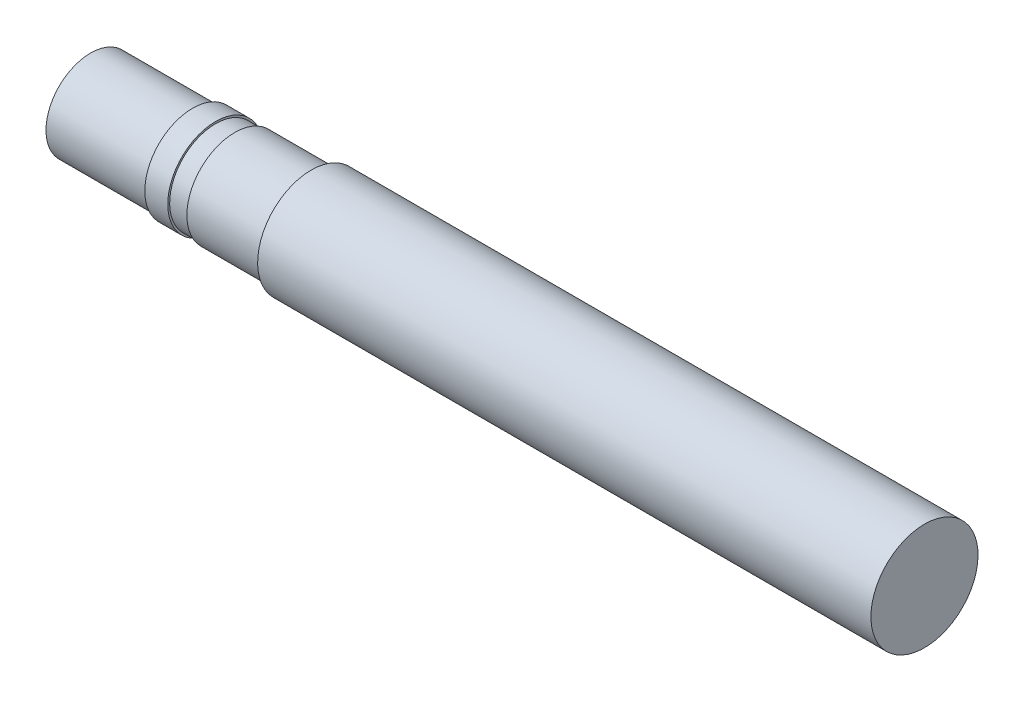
from build123d import *


with BuildPart() as part:
    # Sketch1 → Revolve1 (revolve)
    with BuildSketch(Plane.XY):
        Polygon((-574, 37.5), (-556, 37.5), (-556, 36), (-541, 36), (-541, 37.5), (-481, 37.5), (-481, 42), (0, 42), (0, 0), (-654, 0), (-654, 35), (-574, 35), align=None)
    revolve(axis=Axis((0, 0, 0), (-1, 0, 0)))


solid = part.part
